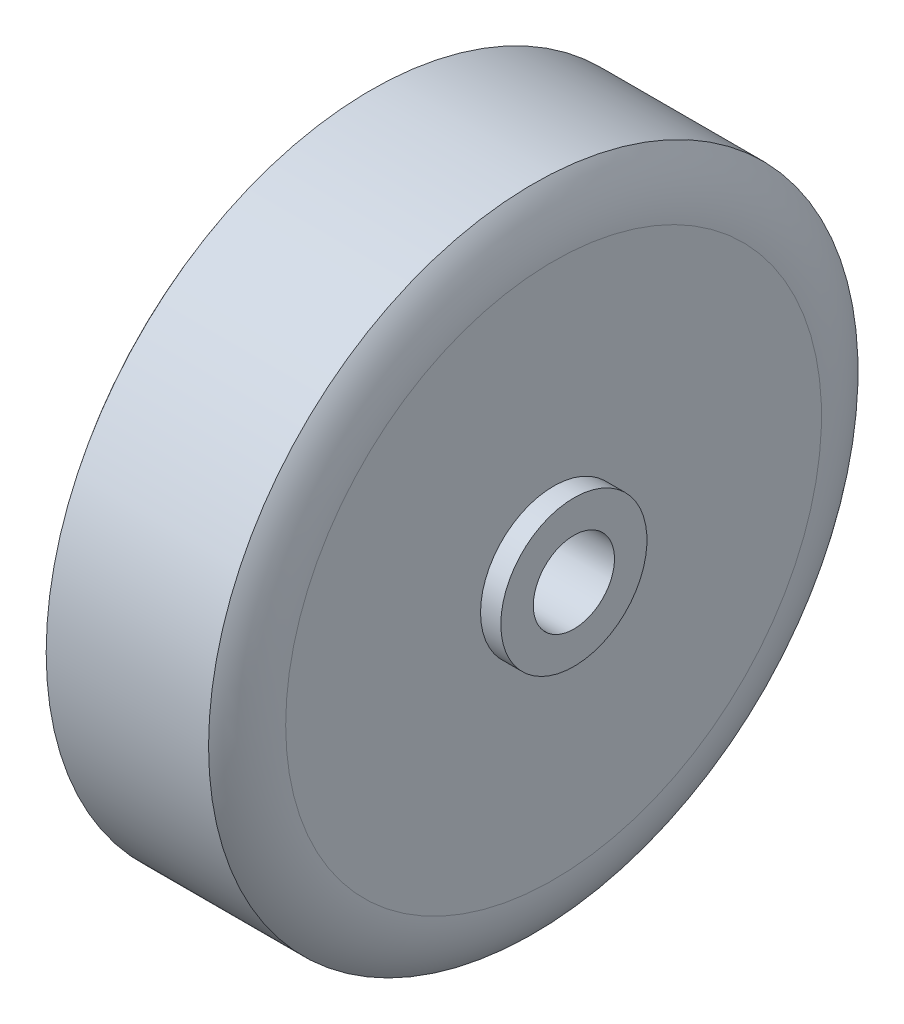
ISO-10303-21;
HEADER;
FILE_DESCRIPTION(('STEP AP214'),'2;1');
FILE_NAME('part.step','',(''),(''),'','','');
FILE_SCHEMA(('AUTOMOTIVE_DESIGN { 1 0 10303 214 1 1 1 1 }'));
ENDSEC;
DATA;
#1=APPLICATION_CONTEXT('core data for automotive mechanical design processes');
#2=APPLICATION_PROTOCOL_DEFINITION('international standard','automotive_design',2000,#1);
#3=PRODUCT_CONTEXT('',#1,'mechanical');
#4=PRODUCT('Part','Part','',(#3));
#5=PRODUCT_RELATED_PRODUCT_CATEGORY('part','',(#4));
#6=PRODUCT_DEFINITION_FORMATION('','',#4);
#7=PRODUCT_DEFINITION_CONTEXT('part definition',#1,'design');
#8=PRODUCT_DEFINITION('design','',#6,#7);
#9=PRODUCT_DEFINITION_SHAPE('','',#8);
#10=(LENGTH_UNIT() NAMED_UNIT(*) SI_UNIT(.MILLI.,.METRE.));
#11=(NAMED_UNIT(*) PLANE_ANGLE_UNIT() SI_UNIT($,.RADIAN.));
#12=(NAMED_UNIT(*) SI_UNIT($,.STERADIAN.) SOLID_ANGLE_UNIT());
#13=UNCERTAINTY_MEASURE_WITH_UNIT(LENGTH_MEASURE(1.E-05),#10,'distance_accuracy_value','');
#14=(GEOMETRIC_REPRESENTATION_CONTEXT(3) GLOBAL_UNCERTAINTY_ASSIGNED_CONTEXT((#13)) GLOBAL_UNIT_ASSIGNED_CONTEXT((#10,
#11,#12)) REPRESENTATION_CONTEXT('',''));
#15=CARTESIAN_POINT('',(0.,0.,0.));
#16=DIRECTION('',(0.,0.,1.));
#17=DIRECTION('',(1.,0.,0.));
#18=AXIS2_PLACEMENT_3D('',#15,#16,#17);
#19=CARTESIAN_POINT('',(-30.,10.,0.));
#20=DIRECTION('',(1.,0.,0.));
#21=DIRECTION('',(0.,0.,-1.));
#22=AXIS2_PLACEMENT_3D('',#19,#20,#21);
#23=PLANE('',#22);
#24=CARTESIAN_POINT('',(-30.,0.,0.));
#25=DIRECTION('',(-1.,0.,0.));
#26=DIRECTION('',(0.,0.,1.));
#27=AXIS2_PLACEMENT_3D('',#24,#25,#26);
#28=CIRCLE('',#27,10.);
#29=CARTESIAN_POINT('',(-30.,0.,10.));
#30=VERTEX_POINT('',#29);
#31=EDGE_CURVE('E62',#30,#30,#28,.T.);
#32=ORIENTED_EDGE('',*,*,#31,.F.);
#33=EDGE_LOOP('',(#32));
#34=FACE_BOUND('',#33,.T.);
#35=CARTESIAN_POINT('',(-30.,0.,0.));
#36=DIRECTION('',(-1.,0.,0.));
#37=DIRECTION('',(0.,0.,1.));
#38=AXIS2_PLACEMENT_3D('',#35,#36,#37);
#39=CIRCLE('',#38,18.);
#40=CARTESIAN_POINT('',(-30.,0.,18.));
#41=VERTEX_POINT('',#40);
#42=EDGE_CURVE('E10',#41,#41,#39,.T.);
#43=ORIENTED_EDGE('',*,*,#42,.T.);
#44=EDGE_LOOP('',(#43));
#45=FACE_BOUND('',#44,.T.);
#46=ADVANCED_FACE('F28',(#34,#45),#23,.F.);
#47=CARTESIAN_POINT('',(-30.,0.,0.));
#48=DIRECTION('',(-1.,0.,0.));
#49=DIRECTION('',(0.,0.,1.));
#50=AXIS2_PLACEMENT_3D('',#47,#48,#49);
#51=CYLINDRICAL_SURFACE('',#50,18.);
#52=ORIENTED_EDGE('',*,*,#42,.F.);
#53=EDGE_LOOP('',(#52));
#54=FACE_BOUND('',#53,.T.);
#55=CARTESIAN_POINT('',(-25.,0.,0.));
#56=DIRECTION('',(-1.,0.,0.));
#57=DIRECTION('',(0.,0.,1.));
#58=AXIS2_PLACEMENT_3D('',#55,#56,#57);
#59=CIRCLE('',#58,18.);
#60=CARTESIAN_POINT('',(-25.,0.,18.));
#61=VERTEX_POINT('',#60);
#62=EDGE_CURVE('E34',#61,#61,#59,.T.);
#63=ORIENTED_EDGE('',*,*,#62,.T.);
#64=EDGE_LOOP('',(#63));
#65=FACE_BOUND('',#64,.T.);
#66=ADVANCED_FACE('F69',(#54,#65),#51,.T.);
#67=CARTESIAN_POINT('',(-25.,18.,0.));
#68=DIRECTION('',(1.,0.,0.));
#69=DIRECTION('',(0.,0.,-1.));
#70=AXIS2_PLACEMENT_3D('',#67,#68,#69);
#71=PLANE('',#70);
#72=ORIENTED_EDGE('',*,*,#62,.F.);
#73=EDGE_LOOP('',(#72));
#74=FACE_BOUND('',#73,.T.);
#75=CARTESIAN_POINT('',(-25.,0.,0.));
#76=DIRECTION('',(-1.,0.,0.));
#77=DIRECTION('',(0.,0.,1.));
#78=AXIS2_PLACEMENT_3D('',#75,#76,#77);
#79=CIRCLE('',#78,66.);
#80=CARTESIAN_POINT('',(-25.,0.,66.));
#81=VERTEX_POINT('',#80);
#82=EDGE_CURVE('E38',#81,#81,#79,.T.);
#83=ORIENTED_EDGE('',*,*,#82,.T.);
#84=EDGE_LOOP('',(#83));
#85=FACE_BOUND('',#84,.T.);
#86=ADVANCED_FACE('F73',(#74,#85),#71,.F.);
#87=CARTESIAN_POINT('',(-2.90000000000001,0.,0.));
#88=DIRECTION('',(-1.,0.,0.));
#89=DIRECTION('',(0.,0.,1.));
#90=AXIS2_PLACEMENT_3D('',#87,#88,#89);
#91=TOROIDAL_SURFACE('',#90,66.,22.1);
#92=ORIENTED_EDGE('',*,*,#82,.F.);
#93=EDGE_LOOP('',(#92));
#94=FACE_BOUND('',#93,.T.);
#95=CARTESIAN_POINT('',(-20.,0.,0.));
#96=DIRECTION('',(-1.,0.,0.));
#97=DIRECTION('',(0.,0.,1.));
#98=AXIS2_PLACEMENT_3D('',#95,#96,#97);
#99=CIRCLE('',#98,80.);
#100=CARTESIAN_POINT('',(-20.,0.,80.));
#101=VERTEX_POINT('',#100);
#102=EDGE_CURVE('E42',#101,#101,#99,.T.);
#103=ORIENTED_EDGE('',*,*,#102,.T.);
#104=EDGE_LOOP('',(#103));
#105=FACE_BOUND('',#104,.T.);
#106=ADVANCED_FACE('F78',(#94,#105),#91,.T.);
#107=CARTESIAN_POINT('',(-30.,0.,0.));
#108=DIRECTION('',(-1.,0.,0.));
#109=DIRECTION('',(0.,0.,1.));
#110=AXIS2_PLACEMENT_3D('',#107,#108,#109);
#111=CYLINDRICAL_SURFACE('',#110,80.);
#112=ORIENTED_EDGE('',*,*,#102,.F.);
#113=EDGE_LOOP('',(#112));
#114=FACE_BOUND('',#113,.T.);
#115=CARTESIAN_POINT('',(20.,0.,0.));
#116=DIRECTION('',(-1.,0.,0.));
#117=DIRECTION('',(0.,0.,1.));
#118=AXIS2_PLACEMENT_3D('',#115,#116,#117);
#119=CIRCLE('',#118,80.);
#120=CARTESIAN_POINT('',(20.,0.,80.));
#121=VERTEX_POINT('',#120);
#122=EDGE_CURVE('E47',#121,#121,#119,.T.);
#123=ORIENTED_EDGE('',*,*,#122,.T.);
#124=EDGE_LOOP('',(#123));
#125=FACE_BOUND('',#124,.T.);
#126=ADVANCED_FACE('F84',(#114,#125),#111,.T.);
#127=CARTESIAN_POINT('',(2.90000000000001,0.,0.));
#128=DIRECTION('',(-1.,0.,0.));
#129=DIRECTION('',(0.,0.,1.));
#130=AXIS2_PLACEMENT_3D('',#127,#128,#129);
#131=TOROIDAL_SURFACE('',#130,66.,22.1);
#132=ORIENTED_EDGE('',*,*,#122,.F.);
#133=EDGE_LOOP('',(#132));
#134=FACE_BOUND('',#133,.T.);
#135=CARTESIAN_POINT('',(25.,0.,0.));
#136=DIRECTION('',(-1.,0.,0.));
#137=DIRECTION('',(0.,0.,1.));
#138=AXIS2_PLACEMENT_3D('',#135,#136,#137);
#139=CIRCLE('',#138,66.);
#140=CARTESIAN_POINT('',(25.,0.,66.));
#141=VERTEX_POINT('',#140);
#142=EDGE_CURVE('E50',#141,#141,#139,.T.);
#143=ORIENTED_EDGE('',*,*,#142,.T.);
#144=EDGE_LOOP('',(#143));
#145=FACE_BOUND('',#144,.T.);
#146=ADVANCED_FACE('F88',(#134,#145),#131,.T.);
#147=CARTESIAN_POINT('',(25.,18.,0.));
#148=DIRECTION('',(-1.,0.,0.));
#149=DIRECTION('',(0.,0.,1.));
#150=AXIS2_PLACEMENT_3D('',#147,#148,#149);
#151=PLANE('',#150);
#152=ORIENTED_EDGE('',*,*,#142,.F.);
#153=EDGE_LOOP('',(#152));
#154=FACE_BOUND('',#153,.T.);
#155=CARTESIAN_POINT('',(25.,0.,0.));
#156=DIRECTION('',(-1.,0.,0.));
#157=DIRECTION('',(0.,0.,1.));
#158=AXIS2_PLACEMENT_3D('',#155,#156,#157);
#159=CIRCLE('',#158,18.);
#160=CARTESIAN_POINT('',(25.,0.,18.));
#161=VERTEX_POINT('',#160);
#162=EDGE_CURVE('E53',#161,#161,#159,.T.);
#163=ORIENTED_EDGE('',*,*,#162,.T.);
#164=EDGE_LOOP('',(#163));
#165=FACE_BOUND('',#164,.T.);
#166=ADVANCED_FACE('F92',(#154,#165),#151,.F.);
#167=CARTESIAN_POINT('',(-30.,0.,0.));
#168=DIRECTION('',(-1.,0.,0.));
#169=DIRECTION('',(0.,0.,1.));
#170=AXIS2_PLACEMENT_3D('',#167,#168,#169);
#171=CYLINDRICAL_SURFACE('',#170,18.);
#172=ORIENTED_EDGE('',*,*,#162,.F.);
#173=EDGE_LOOP('',(#172));
#174=FACE_BOUND('',#173,.T.);
#175=CARTESIAN_POINT('',(30.,0.,0.));
#176=DIRECTION('',(-1.,0.,0.));
#177=DIRECTION('',(0.,0.,1.));
#178=AXIS2_PLACEMENT_3D('',#175,#176,#177);
#179=CIRCLE('',#178,18.);
#180=CARTESIAN_POINT('',(30.,0.,18.));
#181=VERTEX_POINT('',#180);
#182=EDGE_CURVE('E56',#181,#181,#179,.T.);
#183=ORIENTED_EDGE('',*,*,#182,.T.);
#184=EDGE_LOOP('',(#183));
#185=FACE_BOUND('',#184,.T.);
#186=ADVANCED_FACE('F96',(#174,#185),#171,.T.);
#187=CARTESIAN_POINT('',(30.,10.,0.));
#188=DIRECTION('',(-1.,0.,0.));
#189=DIRECTION('',(0.,0.,1.));
#190=AXIS2_PLACEMENT_3D('',#187,#188,#189);
#191=PLANE('',#190);
#192=ORIENTED_EDGE('',*,*,#182,.F.);
#193=EDGE_LOOP('',(#192));
#194=FACE_BOUND('',#193,.T.);
#195=CARTESIAN_POINT('',(30.,0.,0.));
#196=DIRECTION('',(-1.,0.,0.));
#197=DIRECTION('',(0.,0.,1.));
#198=AXIS2_PLACEMENT_3D('',#195,#196,#197);
#199=CIRCLE('',#198,10.);
#200=CARTESIAN_POINT('',(30.,0.,10.));
#201=VERTEX_POINT('',#200);
#202=EDGE_CURVE('E59',#201,#201,#199,.T.);
#203=ORIENTED_EDGE('',*,*,#202,.T.);
#204=EDGE_LOOP('',(#203));
#205=FACE_BOUND('',#204,.T.);
#206=ADVANCED_FACE('F100',(#194,#205),#191,.F.);
#207=CARTESIAN_POINT('',(-30.,0.,0.));
#208=DIRECTION('',(-1.,0.,0.));
#209=DIRECTION('',(0.,0.,1.));
#210=AXIS2_PLACEMENT_3D('',#207,#208,#209);
#211=CYLINDRICAL_SURFACE('',#210,10.);
#212=ORIENTED_EDGE('',*,*,#202,.F.);
#213=EDGE_LOOP('',(#212));
#214=FACE_BOUND('',#213,.T.);
#215=ORIENTED_EDGE('',*,*,#31,.T.);
#216=EDGE_LOOP('',(#215));
#217=FACE_BOUND('',#216,.T.);
#218=ADVANCED_FACE('F66',(#214,#217),#211,.F.);
#219=CLOSED_SHELL('',(#46,#66,#86,#106,#126,#146,#166,#186,#206,#218));
#220=MANIFOLD_SOLID_BREP('B2',#219);
#221=ADVANCED_BREP_SHAPE_REPRESENTATION('',(#18,#220),#14);
#222=SHAPE_DEFINITION_REPRESENTATION(#9,#221);
ENDSEC;
END-ISO-10303-21;
